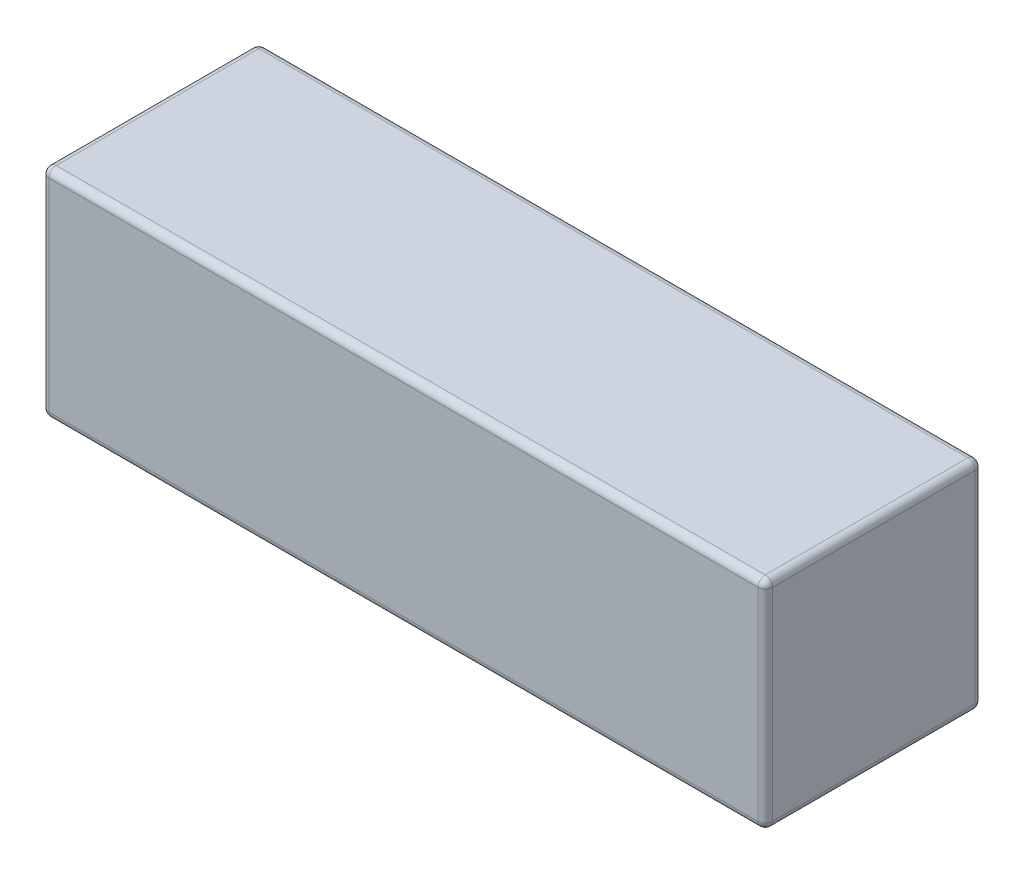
from build123d import *

# Parameters (mm, degrees)
SKETCH1_W           = 30
SKETCH1_H           = 30
BOSS_EXTRUDE1_DEPTH = 50
FILLET1_R           = 1


with BuildPart() as part:
    # Sketch1 → Boss-Extrude1 (new, symmetric)
    with BuildSketch(Plane(origin=(0, 0, 0), x_dir=(0, 0, -1), z_dir=(1, 0, 0))):
        Rectangle(SKETCH1_W, SKETCH1_H)
    extrude(amount=BOSS_EXTRUDE1_DEPTH, both=True)

    # Fillet1
    fillet1_edges = [part.edges().sort_by_distance(p)[0] for p in [
        (50, 0, 15),
        (50, -15, 0),
        (50, 0, -15),
        (-50, -15, 0),
        (-50, 0, 15),
        (-50, 15, 0),
        (-50, 0, -15),
        (0, -15, -15),
        (0, -15, 15),
        (0, 15, 15),
        (0, 15, -15),
        (50, 15, 0),
    ]]
    fillet(fillet1_edges, radius=FILLET1_R)


solid = part.part
